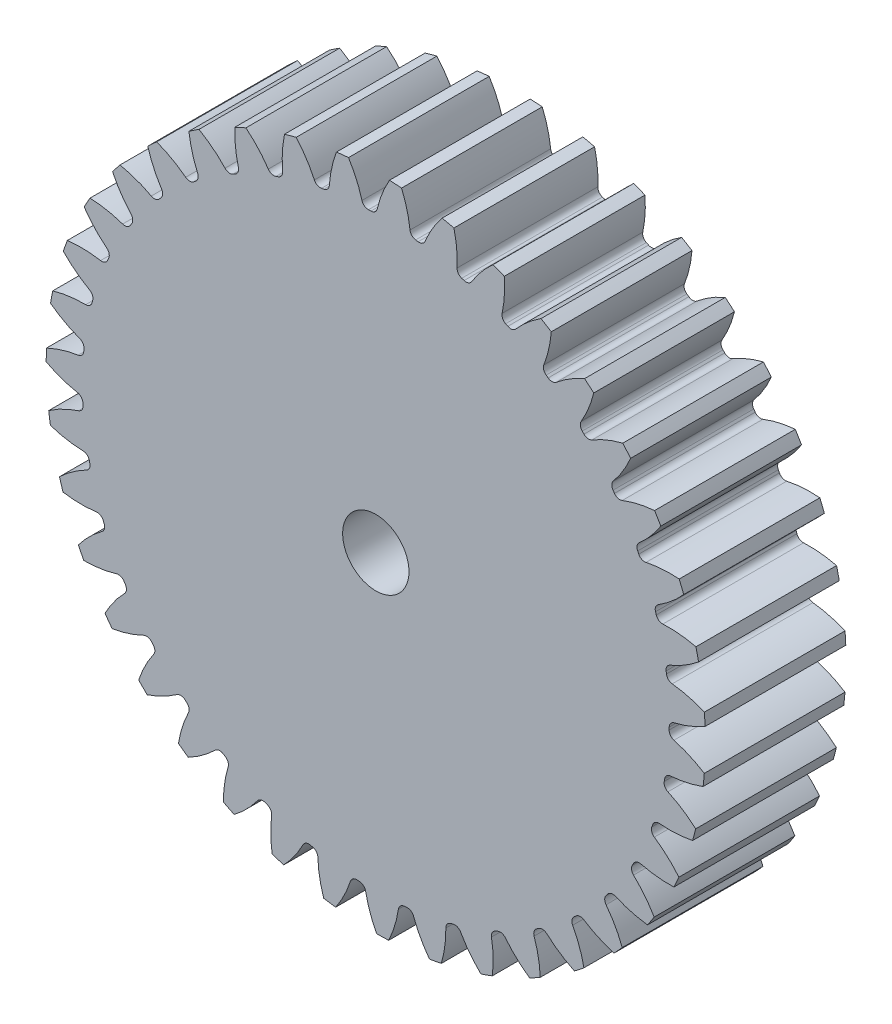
from build123d import *

# Parameters (mm, degrees)
SKETCH3_R         = 208.28
GEARBODY_DEPTH    = 88.9
TOOTHCUT_DEPTH    = 308.675684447
CIRPATTERN1_COUNT = 39
BOREDIA_R         = 20.955
BORE_DEPTH        = 12700


with BuildPart() as part:
    # Sketch3 → gearBody (new body)
    with BuildSketch(Plane.XY):
        Circle(SKETCH3_R)
    extrude(amount=GEARBODY_DEPTH)

    # Sketch2 → toothCut (cut, through all)
    with BuildSketch(Plane.XY):
        with BuildLine():
            ThreePointArc((185.367570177, -4.409118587), (185.384675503, -3.619183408), (185.398414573, -2.829182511))
            ThreePointArc((185.398414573, -2.829182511), (186.309693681, -0.302070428), (188.581391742, 1.131844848))
            ThreePointArc((188.581391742, 1.131844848), (198.721801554, 4.336479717), (208.28, 8.99892953))
            ThreePointArc((208.28, 8.99892953), (208.434596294, -4.069176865), (207.770066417, -17.12129182))
            ThreePointArc((207.770066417, -17.12129182), (198.401127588, -12.089335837), (188.393522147, -8.491360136))
            ThreePointArc((188.393522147, -8.491360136), (186.179521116, -6.969872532), (185.367570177, -4.409118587))
        make_face()
    toothcut = extrude(amount=TOOTHCUT_DEPTH, mode=Mode.SUBTRACT)

    # CirPattern1: toothCut ×39 about axis
    cirpattern1_axis = Axis((0, 0, 0), (0, 0, 1))
    for i in range(1, CIRPATTERN1_COUNT):
        add(toothcut.rotate(cirpattern1_axis, i * 360 / CIRPATTERN1_COUNT), mode=Mode.SUBTRACT)

    # boreDia → bore (cut, symmetric)
    with BuildSketch(Plane.XY):
        Circle(BOREDIA_R)
    extrude(amount=BORE_DEPTH, both=True, mode=Mode.SUBTRACT)


solid = part.part
